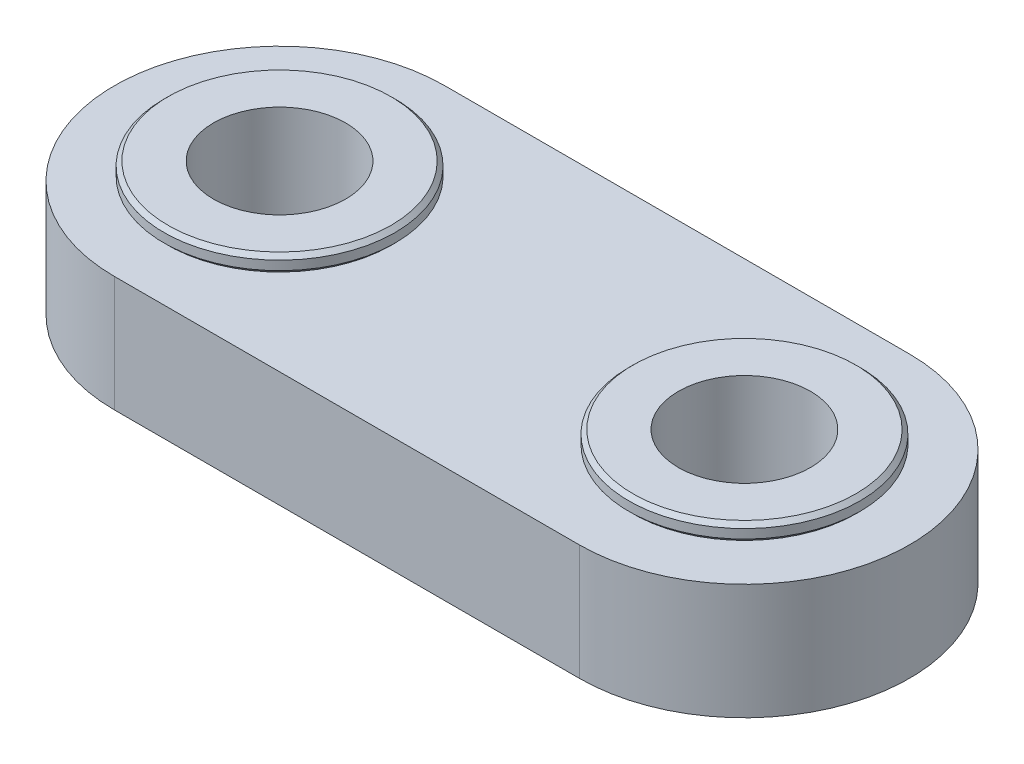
ISO-10303-21;
HEADER;
FILE_DESCRIPTION(('STEP AP214'),'2;1');
FILE_NAME('part.step','',(''),(''),'','','');
FILE_SCHEMA(('AUTOMOTIVE_DESIGN { 1 0 10303 214 1 1 1 1 }'));
ENDSEC;
DATA;
#1=APPLICATION_CONTEXT('core data for automotive mechanical design processes');
#2=APPLICATION_PROTOCOL_DEFINITION('international standard','automotive_design',2000,#1);
#3=PRODUCT_CONTEXT('',#1,'mechanical');
#4=PRODUCT('Part','Part','',(#3));
#5=PRODUCT_RELATED_PRODUCT_CATEGORY('part','',(#4));
#6=PRODUCT_DEFINITION_FORMATION('','',#4);
#7=PRODUCT_DEFINITION_CONTEXT('part definition',#1,'design');
#8=PRODUCT_DEFINITION('design','',#6,#7);
#9=PRODUCT_DEFINITION_SHAPE('','',#8);
#10=(LENGTH_UNIT() NAMED_UNIT(*) SI_UNIT(.MILLI.,.METRE.));
#11=(NAMED_UNIT(*) PLANE_ANGLE_UNIT() SI_UNIT($,.RADIAN.));
#12=(NAMED_UNIT(*) SI_UNIT($,.STERADIAN.) SOLID_ANGLE_UNIT());
#13=UNCERTAINTY_MEASURE_WITH_UNIT(LENGTH_MEASURE(1.E-05),#10,'distance_accuracy_value','');
#14=(GEOMETRIC_REPRESENTATION_CONTEXT(3) GLOBAL_UNCERTAINTY_ASSIGNED_CONTEXT((#13)) GLOBAL_UNIT_ASSIGNED_CONTEXT((#10,
#11,#12)) REPRESENTATION_CONTEXT('',''));
#15=CARTESIAN_POINT('',(0.,0.,0.));
#16=DIRECTION('',(0.,0.,1.));
#17=DIRECTION('',(1.,0.,0.));
#18=AXIS2_PLACEMENT_3D('',#15,#16,#17);
#19=CARTESIAN_POINT('',(0.,-4.6,0.));
#20=DIRECTION('',(0.,1.,0.));
#21=DIRECTION('',(-1.,0.,0.));
#22=AXIS2_PLACEMENT_3D('',#19,#20,#21);
#23=CYLINDRICAL_SURFACE('',#22,4.);
#24=CARTESIAN_POINT('',(0.,-4.55,0.));
#25=DIRECTION('',(0.,-1.,0.));
#26=DIRECTION('',(-1.,0.,0.));
#27=AXIS2_PLACEMENT_3D('',#24,#25,#26);
#28=CIRCLE('',#27,4.);
#29=CARTESIAN_POINT('',(-4.,-4.55,0.));
#30=VERTEX_POINT('',#29);
#31=EDGE_CURVE('E124',#30,#30,#28,.F.);
#32=ORIENTED_EDGE('',*,*,#31,.F.);
#33=EDGE_LOOP('',(#32));
#34=FACE_BOUND('',#33,.T.);
#35=CARTESIAN_POINT('',(0.,4.55,0.));
#36=DIRECTION('',(0.,1.,0.));
#37=DIRECTION('',(1.,0.,0.));
#38=AXIS2_PLACEMENT_3D('',#35,#36,#37);
#39=CIRCLE('',#38,4.);
#40=CARTESIAN_POINT('',(4.,4.55,0.));
#41=VERTEX_POINT('',#40);
#42=EDGE_CURVE('E225',#41,#41,#39,.F.);
#43=ORIENTED_EDGE('',*,*,#42,.F.);
#44=EDGE_LOOP('',(#43));
#45=FACE_BOUND('',#44,.T.);
#46=ADVANCED_FACE('F14',(#34,#45),#23,.F.);
#47=CARTESIAN_POINT('',(0.,-4.6,0.));
#48=DIRECTION('',(0.,1.,0.));
#49=DIRECTION('',(-1.,0.,0.));
#50=AXIS2_PLACEMENT_3D('',#47,#48,#49);
#51=CYLINDRICAL_SURFACE('',#50,7.);
#52=CARTESIAN_POINT('',(0.,4.3,0.));
#53=DIRECTION('',(0.,1.,0.));
#54=DIRECTION('',(1.,0.,0.));
#55=AXIS2_PLACEMENT_3D('',#52,#53,#54);
#56=CIRCLE('',#55,7.);
#57=CARTESIAN_POINT('',(7.,4.3,0.));
#58=VERTEX_POINT('',#57);
#59=EDGE_CURVE('E9',#58,#58,#56,.F.);
#60=ORIENTED_EDGE('',*,*,#59,.T.);
#61=EDGE_LOOP('',(#60));
#62=FACE_BOUND('',#61,.T.);
#63=CARTESIAN_POINT('',(0.,3.75,0.));
#64=DIRECTION('',(0.,1.,0.));
#65=DIRECTION('',(-1.,0.,0.));
#66=AXIS2_PLACEMENT_3D('',#63,#64,#65);
#67=CIRCLE('',#66,7.);
#68=CARTESIAN_POINT('',(-7.,3.75,0.));
#69=VERTEX_POINT('',#68);
#70=EDGE_CURVE('E115',#69,#69,#67,.T.);
#71=ORIENTED_EDGE('',*,*,#70,.T.);
#72=EDGE_LOOP('',(#71));
#73=FACE_BOUND('',#72,.T.);
#74=ADVANCED_FACE('F165',(#62,#73),#51,.T.);
#75=CARTESIAN_POINT('',(28.1439999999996,-4.6,0.));
#76=DIRECTION('',(0.,1.,0.));
#77=DIRECTION('',(-1.,0.,0.));
#78=AXIS2_PLACEMENT_3D('',#75,#76,#77);
#79=CYLINDRICAL_SURFACE('',#78,4.);
#80=CARTESIAN_POINT('',(28.1439999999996,-4.55,0.));
#81=DIRECTION('',(0.,-1.,0.));
#82=DIRECTION('',(-1.,0.,0.));
#83=AXIS2_PLACEMENT_3D('',#80,#81,#82);
#84=CIRCLE('',#83,4.);
#85=CARTESIAN_POINT('',(24.1439999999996,-4.55,0.));
#86=VERTEX_POINT('',#85);
#87=EDGE_CURVE('E127',#86,#86,#84,.F.);
#88=ORIENTED_EDGE('',*,*,#87,.F.);
#89=EDGE_LOOP('',(#88));
#90=FACE_BOUND('',#89,.T.);
#91=CARTESIAN_POINT('',(28.1439999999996,4.55,0.));
#92=DIRECTION('',(0.,1.,0.));
#93=DIRECTION('',(1.,0.,0.));
#94=AXIS2_PLACEMENT_3D('',#91,#92,#93);
#95=CIRCLE('',#94,4.);
#96=CARTESIAN_POINT('',(32.1439999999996,4.55,0.));
#97=VERTEX_POINT('',#96);
#98=EDGE_CURVE('E130',#97,#97,#95,.F.);
#99=ORIENTED_EDGE('',*,*,#98,.F.);
#100=EDGE_LOOP('',(#99));
#101=FACE_BOUND('',#100,.T.);
#102=ADVANCED_FACE('F172',(#90,#101),#79,.F.);
#103=CARTESIAN_POINT('',(28.1439999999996,-4.6,0.));
#104=DIRECTION('',(0.,1.,0.));
#105=DIRECTION('',(-1.,0.,0.));
#106=AXIS2_PLACEMENT_3D('',#103,#104,#105);
#107=CYLINDRICAL_SURFACE('',#106,7.);
#108=CARTESIAN_POINT('',(28.1439999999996,4.3,0.));
#109=DIRECTION('',(0.,1.,0.));
#110=DIRECTION('',(1.,0.,0.));
#111=AXIS2_PLACEMENT_3D('',#108,#109,#110);
#112=CIRCLE('',#111,7.);
#113=CARTESIAN_POINT('',(35.1439999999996,4.3,0.));
#114=VERTEX_POINT('',#113);
#115=EDGE_CURVE('E145',#114,#114,#112,.F.);
#116=ORIENTED_EDGE('',*,*,#115,.T.);
#117=EDGE_LOOP('',(#116));
#118=FACE_BOUND('',#117,.T.);
#119=CARTESIAN_POINT('',(28.1439999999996,3.75,0.));
#120=DIRECTION('',(0.,1.,0.));
#121=DIRECTION('',(-1.,0.,0.));
#122=AXIS2_PLACEMENT_3D('',#119,#120,#121);
#123=CIRCLE('',#122,7.);
#124=CARTESIAN_POINT('',(21.1439999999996,3.75,0.));
#125=VERTEX_POINT('',#124);
#126=EDGE_CURVE('E108',#125,#125,#123,.T.);
#127=ORIENTED_EDGE('',*,*,#126,.T.);
#128=EDGE_LOOP('',(#127));
#129=FACE_BOUND('',#128,.T.);
#130=ADVANCED_FACE('F193',(#118,#129),#107,.T.);
#131=CARTESIAN_POINT('',(28.1439999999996,-3.5,0.));
#132=DIRECTION('',(0.,-1.,0.));
#133=DIRECTION('',(1.,0.,0.));
#134=AXIS2_PLACEMENT_3D('',#131,#132,#133);
#135=CYLINDRICAL_SURFACE('',#134,7.5);
#136=CARTESIAN_POINT('',(28.1439999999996,-4.3,0.));
#137=DIRECTION('',(0.,-1.,0.));
#138=DIRECTION('',(-1.,0.,0.));
#139=AXIS2_PLACEMENT_3D('',#136,#137,#138);
#140=CIRCLE('',#139,7.5);
#141=CARTESIAN_POINT('',(20.6439999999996,-4.3,0.));
#142=VERTEX_POINT('',#141);
#143=EDGE_CURVE('E139',#142,#142,#140,.F.);
#144=ORIENTED_EDGE('',*,*,#143,.T.);
#145=EDGE_LOOP('',(#144));
#146=FACE_BOUND('',#145,.T.);
#147=CARTESIAN_POINT('',(28.1439999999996,-3.7,0.));
#148=DIRECTION('',(0.,-1.,0.));
#149=DIRECTION('',(1.,0.,0.));
#150=AXIS2_PLACEMENT_3D('',#147,#148,#149);
#151=CIRCLE('',#150,7.5);
#152=CARTESIAN_POINT('',(35.6439999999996,-3.7,0.));
#153=VERTEX_POINT('',#152);
#154=EDGE_CURVE('E121',#153,#153,#151,.T.);
#155=ORIENTED_EDGE('',*,*,#154,.T.);
#156=EDGE_LOOP('',(#155));
#157=FACE_BOUND('',#156,.T.);
#158=ADVANCED_FACE('F183',(#146,#157),#135,.T.);
#159=CARTESIAN_POINT('',(0.,-3.5,0.));
#160=DIRECTION('',(0.,-1.,0.));
#161=DIRECTION('',(1.,0.,0.));
#162=AXIS2_PLACEMENT_3D('',#159,#160,#161);
#163=CYLINDRICAL_SURFACE('',#162,7.5);
#164=CARTESIAN_POINT('',(0.,-4.3,0.));
#165=DIRECTION('',(0.,-1.,0.));
#166=DIRECTION('',(-1.,0.,0.));
#167=AXIS2_PLACEMENT_3D('',#164,#165,#166);
#168=CIRCLE('',#167,7.5);
#169=CARTESIAN_POINT('',(-7.5,-4.3,0.));
#170=VERTEX_POINT('',#169);
#171=EDGE_CURVE('E133',#170,#170,#168,.F.);
#172=ORIENTED_EDGE('',*,*,#171,.T.);
#173=EDGE_LOOP('',(#172));
#174=FACE_BOUND('',#173,.T.);
#175=CARTESIAN_POINT('',(0.,-3.7,0.));
#176=DIRECTION('',(0.,-1.,0.));
#177=DIRECTION('',(1.,0.,0.));
#178=AXIS2_PLACEMENT_3D('',#175,#176,#177);
#179=CIRCLE('',#178,7.5);
#180=CARTESIAN_POINT('',(7.5,-3.7,0.));
#181=VERTEX_POINT('',#180);
#182=EDGE_CURVE('E118',#181,#181,#179,.T.);
#183=ORIENTED_EDGE('',*,*,#182,.T.);
#184=EDGE_LOOP('',(#183));
#185=FACE_BOUND('',#184,.T.);
#186=ADVANCED_FACE('F180',(#174,#185),#163,.T.);
#187=CARTESIAN_POINT('',(0.,0.,0.));
#188=DIRECTION('',(0.,-1.,0.));
#189=DIRECTION('',(-1.,0.,0.));
#190=AXIS2_PLACEMENT_3D('',#187,#188,#189);
#191=CYLINDRICAL_SURFACE('',#190,10.);
#192=CARTESIAN_POINT('',(0.,-3.5,0.));
#193=DIRECTION('',(0.,1.,0.));
#194=DIRECTION('',(1.,0.,0.));
#195=AXIS2_PLACEMENT_3D('',#192,#193,#194);
#196=CIRCLE('',#195,10.);
#197=CARTESIAN_POINT('',(0.,-3.5,-10.));
#198=VERTEX_POINT('',#197);
#199=CARTESIAN_POINT('',(0.,-3.5,10.));
#200=VERTEX_POINT('',#199);
#201=EDGE_CURVE('E59',#198,#200,#196,.T.);
#202=ORIENTED_EDGE('',*,*,#201,.T.);
#203=DIRECTION('',(0.,-1.,0.));
#204=VECTOR('',#203,1.);
#205=CARTESIAN_POINT('',(0.,0.,10.));
#206=LINE('',#205,#204);
#207=CARTESIAN_POINT('',(0.,3.5,10.));
#208=VERTEX_POINT('',#207);
#209=EDGE_CURVE('E65',#208,#200,#206,.T.);
#210=ORIENTED_EDGE('',*,*,#209,.F.);
#211=CARTESIAN_POINT('',(0.,3.5,0.));
#212=DIRECTION('',(0.,1.,0.));
#213=DIRECTION('',(1.,0.,0.));
#214=AXIS2_PLACEMENT_3D('',#211,#212,#213);
#215=CIRCLE('',#214,10.);
#216=CARTESIAN_POINT('',(0.,3.5,-10.));
#217=VERTEX_POINT('',#216);
#218=EDGE_CURVE('E99',#217,#208,#215,.T.);
#219=ORIENTED_EDGE('',*,*,#218,.F.);
#220=DIRECTION('',(0.,-1.,0.));
#221=VECTOR('',#220,1.);
#222=CARTESIAN_POINT('',(0.,0.,-10.));
#223=LINE('',#222,#221);
#224=EDGE_CURVE('E67',#217,#198,#223,.T.);
#225=ORIENTED_EDGE('',*,*,#224,.T.);
#226=EDGE_LOOP('',(#202,#210,#219,#225));
#227=FACE_BOUND('',#226,.T.);
#228=ADVANCED_FACE('F63',(#227),#191,.T.);
#229=CARTESIAN_POINT('',(0.,0.,10.));
#230=DIRECTION('',(0.,0.,-1.));
#231=DIRECTION('',(0.,1.,0.));
#232=AXIS2_PLACEMENT_3D('',#229,#230,#231);
#233=PLANE('',#232);
#234=DIRECTION('',(1.,0.,0.));
#235=VECTOR('',#234,1.);
#236=CARTESIAN_POINT('',(0.,-3.5,10.));
#237=LINE('',#236,#235);
#238=CARTESIAN_POINT('',(28.144,-3.5,10.));
#239=VERTEX_POINT('',#238);
#240=EDGE_CURVE('E70',#200,#239,#237,.T.);
#241=ORIENTED_EDGE('',*,*,#240,.T.);
#242=DIRECTION('',(0.,-1.,0.));
#243=VECTOR('',#242,1.);
#244=CARTESIAN_POINT('',(28.144,0.,10.));
#245=LINE('',#244,#243);
#246=CARTESIAN_POINT('',(28.144,3.5,10.));
#247=VERTEX_POINT('',#246);
#248=EDGE_CURVE('E47',#247,#239,#245,.T.);
#249=ORIENTED_EDGE('',*,*,#248,.F.);
#250=DIRECTION('',(1.,0.,0.));
#251=VECTOR('',#250,1.);
#252=CARTESIAN_POINT('',(0.,3.5,10.));
#253=LINE('',#252,#251);
#254=EDGE_CURVE('E74',#208,#247,#253,.T.);
#255=ORIENTED_EDGE('',*,*,#254,.F.);
#256=ORIENTED_EDGE('',*,*,#209,.T.);
#257=EDGE_LOOP('',(#241,#249,#255,#256));
#258=FACE_BOUND('',#257,.T.);
#259=ADVANCED_FACE('F73',(#258),#233,.F.);
#260=CARTESIAN_POINT('',(28.144,0.,0.));
#261=DIRECTION('',(0.,-1.,0.));
#262=DIRECTION('',(-1.,0.,0.));
#263=AXIS2_PLACEMENT_3D('',#260,#261,#262);
#264=CYLINDRICAL_SURFACE('',#263,10.);
#265=CARTESIAN_POINT('',(28.144,-3.5,0.));
#266=DIRECTION('',(0.,1.,0.));
#267=DIRECTION('',(-1.,0.,0.));
#268=AXIS2_PLACEMENT_3D('',#265,#266,#267);
#269=CIRCLE('',#268,10.);
#270=CARTESIAN_POINT('',(28.144,-3.5,-10.));
#271=VERTEX_POINT('',#270);
#272=EDGE_CURVE('E31',#239,#271,#269,.T.);
#273=ORIENTED_EDGE('',*,*,#272,.T.);
#274=DIRECTION('',(0.,-1.,0.));
#275=VECTOR('',#274,1.);
#276=CARTESIAN_POINT('',(28.144,0.,-10.));
#277=LINE('',#276,#275);
#278=CARTESIAN_POINT('',(28.144,3.5,-10.));
#279=VERTEX_POINT('',#278);
#280=EDGE_CURVE('E51',#279,#271,#277,.T.);
#281=ORIENTED_EDGE('',*,*,#280,.F.);
#282=CARTESIAN_POINT('',(28.144,3.5,0.));
#283=DIRECTION('',(0.,1.,0.));
#284=DIRECTION('',(-1.,0.,0.));
#285=AXIS2_PLACEMENT_3D('',#282,#283,#284);
#286=CIRCLE('',#285,10.);
#287=EDGE_CURVE('E103',#247,#279,#286,.T.);
#288=ORIENTED_EDGE('',*,*,#287,.F.);
#289=ORIENTED_EDGE('',*,*,#248,.T.);
#290=EDGE_LOOP('',(#273,#281,#288,#289));
#291=FACE_BOUND('',#290,.T.);
#292=ADVANCED_FACE('F246',(#291),#264,.T.);
#293=CARTESIAN_POINT('',(28.144,0.,-10.));
#294=DIRECTION('',(0.,0.,1.));
#295=DIRECTION('',(0.,-1.,0.));
#296=AXIS2_PLACEMENT_3D('',#293,#294,#295);
#297=PLANE('',#296);
#298=DIRECTION('',(-1.,0.,0.));
#299=VECTOR('',#298,1.);
#300=CARTESIAN_POINT('',(28.144,-3.5,-10.));
#301=LINE('',#300,#299);
#302=EDGE_CURVE('E71',#271,#198,#301,.T.);
#303=ORIENTED_EDGE('',*,*,#302,.T.);
#304=ORIENTED_EDGE('',*,*,#224,.F.);
#305=DIRECTION('',(-1.,0.,0.));
#306=VECTOR('',#305,1.);
#307=CARTESIAN_POINT('',(28.144,3.5,-10.));
#308=LINE('',#307,#306);
#309=EDGE_CURVE('E101',#279,#217,#308,.T.);
#310=ORIENTED_EDGE('',*,*,#309,.F.);
#311=ORIENTED_EDGE('',*,*,#280,.T.);
#312=EDGE_LOOP('',(#303,#304,#310,#311));
#313=FACE_BOUND('',#312,.T.);
#314=ADVANCED_FACE('F244',(#313),#297,.F.);
#315=CARTESIAN_POINT('',(0.,-3.5,0.));
#316=DIRECTION('',(0.,1.,0.));
#317=DIRECTION('',(1.,0.,0.));
#318=AXIS2_PLACEMENT_3D('',#315,#316,#317);
#319=PLANE('',#318);
#320=CARTESIAN_POINT('',(28.1439999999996,-3.5,0.));
#321=DIRECTION('',(0.,1.,0.));
#322=DIRECTION('',(1.,0.,0.));
#323=AXIS2_PLACEMENT_3D('',#320,#321,#322);
#324=CIRCLE('',#323,7.3);
#325=CARTESIAN_POINT('',(35.4439999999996,-3.5,0.));
#326=VERTEX_POINT('',#325);
#327=EDGE_CURVE('E92',#326,#326,#324,.F.);
#328=ORIENTED_EDGE('',*,*,#327,.F.);
#329=EDGE_LOOP('',(#328));
#330=FACE_BOUND('',#329,.T.);
#331=ORIENTED_EDGE('',*,*,#302,.F.);
#332=ORIENTED_EDGE('',*,*,#272,.F.);
#333=ORIENTED_EDGE('',*,*,#240,.F.);
#334=ORIENTED_EDGE('',*,*,#201,.F.);
#335=EDGE_LOOP('',(#331,#332,#333,#334));
#336=FACE_BOUND('',#335,.T.);
#337=CARTESIAN_POINT('',(0.,-3.5,0.));
#338=DIRECTION('',(0.,1.,0.));
#339=DIRECTION('',(1.,0.,0.));
#340=AXIS2_PLACEMENT_3D('',#337,#338,#339);
#341=CIRCLE('',#340,7.3);
#342=CARTESIAN_POINT('',(7.3,-3.5,0.));
#343=VERTEX_POINT('',#342);
#344=EDGE_CURVE('E95',#343,#343,#341,.F.);
#345=ORIENTED_EDGE('',*,*,#344,.F.);
#346=EDGE_LOOP('',(#345));
#347=FACE_BOUND('',#346,.T.);
#348=ADVANCED_FACE('F76',(#330,#336,#347),#319,.F.);
#349=CARTESIAN_POINT('',(28.1439999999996,-3.5,0.));
#350=DIRECTION('',(0.,-1.,0.));
#351=DIRECTION('',(1.,0.,0.));
#352=AXIS2_PLACEMENT_3D('',#349,#350,#351);
#353=CONICAL_SURFACE('',#352,7.3,0.785398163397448);
#354=ORIENTED_EDGE('',*,*,#154,.F.);
#355=EDGE_LOOP('',(#354));
#356=FACE_BOUND('',#355,.T.);
#357=ORIENTED_EDGE('',*,*,#327,.T.);
#358=EDGE_LOOP('',(#357));
#359=FACE_BOUND('',#358,.T.);
#360=ADVANCED_FACE('F185',(#356,#359),#353,.T.);
#361=CARTESIAN_POINT('',(0.,-3.5,0.));
#362=DIRECTION('',(0.,-1.,0.));
#363=DIRECTION('',(1.,0.,0.));
#364=AXIS2_PLACEMENT_3D('',#361,#362,#363);
#365=CONICAL_SURFACE('',#364,7.3,0.785398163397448);
#366=ORIENTED_EDGE('',*,*,#182,.F.);
#367=EDGE_LOOP('',(#366));
#368=FACE_BOUND('',#367,.T.);
#369=ORIENTED_EDGE('',*,*,#344,.T.);
#370=EDGE_LOOP('',(#369));
#371=FACE_BOUND('',#370,.T.);
#372=ADVANCED_FACE('F186',(#368,#371),#365,.T.);
#373=CARTESIAN_POINT('',(28.1439999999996,3.5,0.));
#374=DIRECTION('',(0.,1.,0.));
#375=DIRECTION('',(-1.,0.,0.));
#376=AXIS2_PLACEMENT_3D('',#373,#374,#375);
#377=CONICAL_SURFACE('',#376,6.75,0.785398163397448);
#378=ORIENTED_EDGE('',*,*,#126,.F.);
#379=EDGE_LOOP('',(#378));
#380=FACE_BOUND('',#379,.T.);
#381=CARTESIAN_POINT('',(28.1439999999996,3.5,0.));
#382=DIRECTION('',(0.,1.,0.));
#383=DIRECTION('',(1.,0.,0.));
#384=AXIS2_PLACEMENT_3D('',#381,#382,#383);
#385=CIRCLE('',#384,6.75);
#386=CARTESIAN_POINT('',(34.8939999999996,3.5,0.));
#387=VERTEX_POINT('',#386);
#388=EDGE_CURVE('E88',#387,#387,#385,.F.);
#389=ORIENTED_EDGE('',*,*,#388,.F.);
#390=EDGE_LOOP('',(#389));
#391=FACE_BOUND('',#390,.T.);
#392=ADVANCED_FACE('F189',(#380,#391),#377,.T.);
#393=CARTESIAN_POINT('',(0.,3.5,0.));
#394=DIRECTION('',(0.,1.,0.));
#395=DIRECTION('',(-1.,0.,0.));
#396=AXIS2_PLACEMENT_3D('',#393,#394,#395);
#397=CONICAL_SURFACE('',#396,6.75,0.785398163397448);
#398=ORIENTED_EDGE('',*,*,#70,.F.);
#399=EDGE_LOOP('',(#398));
#400=FACE_BOUND('',#399,.T.);
#401=CARTESIAN_POINT('',(0.,3.5,0.));
#402=DIRECTION('',(0.,1.,0.));
#403=DIRECTION('',(1.,0.,0.));
#404=AXIS2_PLACEMENT_3D('',#401,#402,#403);
#405=CIRCLE('',#404,6.75);
#406=CARTESIAN_POINT('',(6.75,3.5,0.));
#407=VERTEX_POINT('',#406);
#408=EDGE_CURVE('E105',#407,#407,#405,.F.);
#409=ORIENTED_EDGE('',*,*,#408,.F.);
#410=EDGE_LOOP('',(#409));
#411=FACE_BOUND('',#410,.T.);
#412=ADVANCED_FACE('F179',(#400,#411),#397,.T.);
#413=CARTESIAN_POINT('',(0.,3.5,0.));
#414=DIRECTION('',(0.,1.,0.));
#415=DIRECTION('',(1.,0.,0.));
#416=AXIS2_PLACEMENT_3D('',#413,#414,#415);
#417=PLANE('',#416);
#418=ORIENTED_EDGE('',*,*,#408,.T.);
#419=EDGE_LOOP('',(#418));
#420=FACE_BOUND('',#419,.T.);
#421=ORIENTED_EDGE('',*,*,#309,.T.);
#422=ORIENTED_EDGE('',*,*,#218,.T.);
#423=ORIENTED_EDGE('',*,*,#254,.T.);
#424=ORIENTED_EDGE('',*,*,#287,.T.);
#425=EDGE_LOOP('',(#421,#422,#423,#424));
#426=FACE_BOUND('',#425,.T.);
#427=ORIENTED_EDGE('',*,*,#388,.T.);
#428=EDGE_LOOP('',(#427));
#429=FACE_BOUND('',#428,.T.);
#430=ADVANCED_FACE('F240',(#420,#426,#429),#417,.T.);
#431=CARTESIAN_POINT('',(0.,-4.55,0.));
#432=DIRECTION('',(0.,-1.,0.));
#433=DIRECTION('',(-1.,0.,0.));
#434=AXIS2_PLACEMENT_3D('',#431,#432,#433);
#435=PLANE('',#434);
#436=CARTESIAN_POINT('',(0.,-4.55,0.));
#437=DIRECTION('',(0.,-1.,0.));
#438=DIRECTION('',(-1.,0.,0.));
#439=AXIS2_PLACEMENT_3D('',#436,#437,#438);
#440=CIRCLE('',#439,7.25);
#441=CARTESIAN_POINT('',(-7.25,-4.55,0.));
#442=VERTEX_POINT('',#441);
#443=EDGE_CURVE('E98',#442,#442,#440,.T.);
#444=ORIENTED_EDGE('',*,*,#443,.T.);
#445=EDGE_LOOP('',(#444));
#446=FACE_BOUND('',#445,.T.);
#447=ORIENTED_EDGE('',*,*,#31,.T.);
#448=EDGE_LOOP('',(#447));
#449=FACE_BOUND('',#448,.T.);
#450=ADVANCED_FACE('F215',(#446,#449),#435,.T.);
#451=CARTESIAN_POINT('',(28.1439999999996,-4.55,0.));
#452=DIRECTION('',(0.,-1.,0.));
#453=DIRECTION('',(-1.,0.,0.));
#454=AXIS2_PLACEMENT_3D('',#451,#452,#453);
#455=PLANE('',#454);
#456=CARTESIAN_POINT('',(28.1439999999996,-4.55,0.));
#457=DIRECTION('',(0.,-1.,0.));
#458=DIRECTION('',(-1.,0.,0.));
#459=AXIS2_PLACEMENT_3D('',#456,#457,#458);
#460=CIRCLE('',#459,7.25);
#461=CARTESIAN_POINT('',(20.8939999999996,-4.55,0.));
#462=VERTEX_POINT('',#461);
#463=EDGE_CURVE('E136',#462,#462,#460,.T.);
#464=ORIENTED_EDGE('',*,*,#463,.T.);
#465=EDGE_LOOP('',(#464));
#466=FACE_BOUND('',#465,.T.);
#467=ORIENTED_EDGE('',*,*,#87,.T.);
#468=EDGE_LOOP('',(#467));
#469=FACE_BOUND('',#468,.T.);
#470=ADVANCED_FACE('F211',(#466,#469),#455,.T.);
#471=CARTESIAN_POINT('',(28.1439999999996,4.55,0.));
#472=DIRECTION('',(0.,1.,0.));
#473=DIRECTION('',(1.,0.,0.));
#474=AXIS2_PLACEMENT_3D('',#471,#472,#473);
#475=PLANE('',#474);
#476=CARTESIAN_POINT('',(28.1439999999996,4.55,0.));
#477=DIRECTION('',(0.,1.,0.));
#478=DIRECTION('',(1.,0.,0.));
#479=AXIS2_PLACEMENT_3D('',#476,#477,#478);
#480=CIRCLE('',#479,6.75);
#481=CARTESIAN_POINT('',(34.8939999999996,4.55,0.));
#482=VERTEX_POINT('',#481);
#483=EDGE_CURVE('E142',#482,#482,#480,.T.);
#484=ORIENTED_EDGE('',*,*,#483,.T.);
#485=EDGE_LOOP('',(#484));
#486=FACE_BOUND('',#485,.T.);
#487=ORIENTED_EDGE('',*,*,#98,.T.);
#488=EDGE_LOOP('',(#487));
#489=FACE_BOUND('',#488,.T.);
#490=ADVANCED_FACE('F214',(#486,#489),#475,.T.);
#491=CARTESIAN_POINT('',(0.,4.55,0.));
#492=DIRECTION('',(0.,1.,0.));
#493=DIRECTION('',(1.,0.,0.));
#494=AXIS2_PLACEMENT_3D('',#491,#492,#493);
#495=PLANE('',#494);
#496=CARTESIAN_POINT('',(0.,4.55,0.));
#497=DIRECTION('',(0.,1.,0.));
#498=DIRECTION('',(1.,0.,0.));
#499=AXIS2_PLACEMENT_3D('',#496,#497,#498);
#500=CIRCLE('',#499,6.75);
#501=CARTESIAN_POINT('',(6.75,4.55,0.));
#502=VERTEX_POINT('',#501);
#503=EDGE_CURVE('E23',#502,#502,#500,.T.);
#504=ORIENTED_EDGE('',*,*,#503,.T.);
#505=EDGE_LOOP('',(#504));
#506=FACE_BOUND('',#505,.T.);
#507=ORIENTED_EDGE('',*,*,#42,.T.);
#508=EDGE_LOOP('',(#507));
#509=FACE_BOUND('',#508,.T.);
#510=ADVANCED_FACE('F150',(#506,#509),#495,.T.);
#511=CARTESIAN_POINT('',(0.,-4.55,0.));
#512=DIRECTION('',(0.,1.,0.));
#513=DIRECTION('',(1.,0.,0.));
#514=AXIS2_PLACEMENT_3D('',#511,#512,#513);
#515=CONICAL_SURFACE('',#514,7.25,0.785398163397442);
#516=ORIENTED_EDGE('',*,*,#171,.F.);
#517=EDGE_LOOP('',(#516));
#518=FACE_BOUND('',#517,.T.);
#519=ORIENTED_EDGE('',*,*,#443,.F.);
#520=EDGE_LOOP('',(#519));
#521=FACE_BOUND('',#520,.T.);
#522=ADVANCED_FACE('F198',(#518,#521),#515,.T.);
#523=CARTESIAN_POINT('',(28.1439999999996,-4.55,0.));
#524=DIRECTION('',(0.,1.,0.));
#525=DIRECTION('',(1.,0.,0.));
#526=AXIS2_PLACEMENT_3D('',#523,#524,#525);
#527=CONICAL_SURFACE('',#526,7.25,0.785398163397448);
#528=ORIENTED_EDGE('',*,*,#143,.F.);
#529=EDGE_LOOP('',(#528));
#530=FACE_BOUND('',#529,.T.);
#531=ORIENTED_EDGE('',*,*,#463,.F.);
#532=EDGE_LOOP('',(#531));
#533=FACE_BOUND('',#532,.T.);
#534=ADVANCED_FACE('F161',(#530,#533),#527,.T.);
#535=CARTESIAN_POINT('',(28.1439999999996,4.55,0.));
#536=DIRECTION('',(0.,-1.,0.));
#537=DIRECTION('',(-1.,0.,0.));
#538=AXIS2_PLACEMENT_3D('',#535,#536,#537);
#539=CONICAL_SURFACE('',#538,6.75,0.785398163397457);
#540=ORIENTED_EDGE('',*,*,#115,.F.);
#541=EDGE_LOOP('',(#540));
#542=FACE_BOUND('',#541,.T.);
#543=ORIENTED_EDGE('',*,*,#483,.F.);
#544=EDGE_LOOP('',(#543));
#545=FACE_BOUND('',#544,.T.);
#546=ADVANCED_FACE('F154',(#542,#545),#539,.T.);
#547=CARTESIAN_POINT('',(0.,4.55,0.));
#548=DIRECTION('',(0.,-1.,0.));
#549=DIRECTION('',(-1.,0.,0.));
#550=AXIS2_PLACEMENT_3D('',#547,#548,#549);
#551=CONICAL_SURFACE('',#550,6.75,0.785398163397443);
#552=ORIENTED_EDGE('',*,*,#59,.F.);
#553=EDGE_LOOP('',(#552));
#554=FACE_BOUND('',#553,.T.);
#555=ORIENTED_EDGE('',*,*,#503,.F.);
#556=EDGE_LOOP('',(#555));
#557=FACE_BOUND('',#556,.T.);
#558=ADVANCED_FACE('F16',(#554,#557),#551,.T.);
#559=CLOSED_SHELL('',(#46,#74,#102,#130,#158,#186,#228,#259,#292,#314,#348,#360,#372,#392,#412,
#430,#450,#470,#490,#510,#522,#534,#546,#558));
#560=MANIFOLD_SOLID_BREP('B1',#559);
#561=ADVANCED_BREP_SHAPE_REPRESENTATION('',(#18,#560),#14);
#562=SHAPE_DEFINITION_REPRESENTATION(#9,#561);
ENDSEC;
END-ISO-10303-21;
